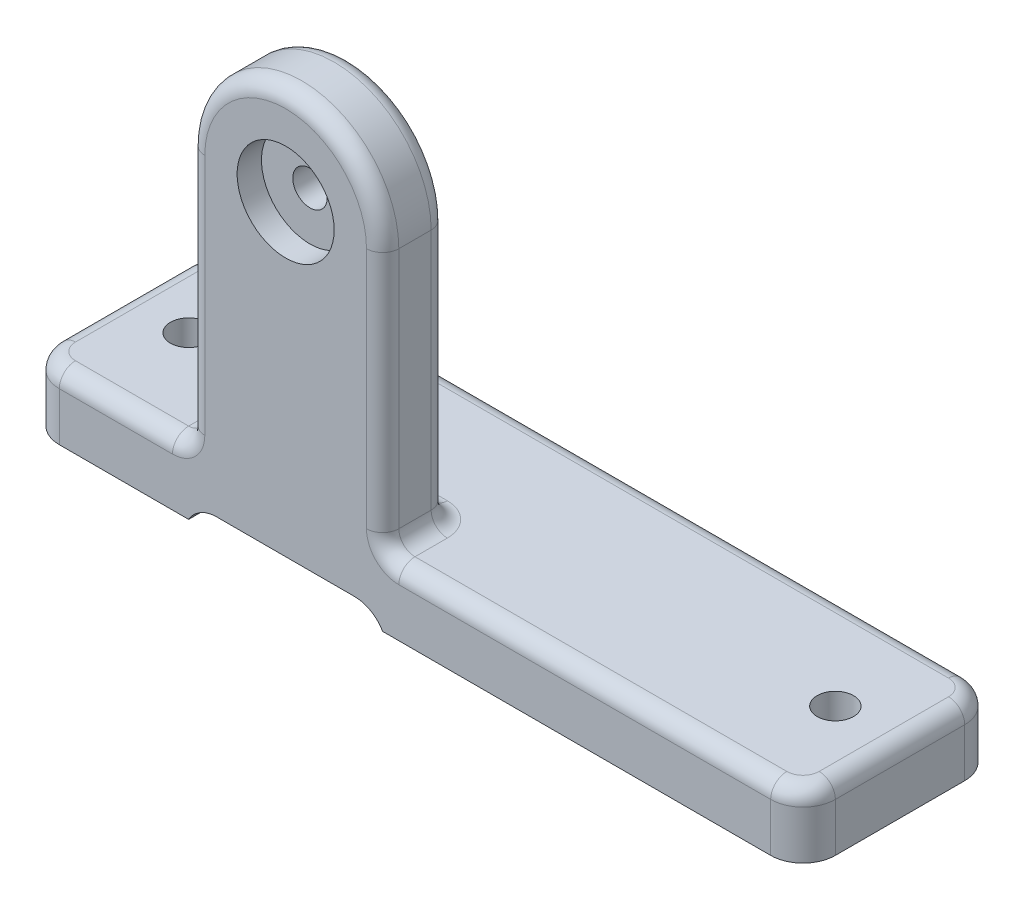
ISO-10303-21;
HEADER;
FILE_DESCRIPTION(('STEP AP214'),'2;1');
FILE_NAME('part.step','',(''),(''),'','','');
FILE_SCHEMA(('AUTOMOTIVE_DESIGN { 1 0 10303 214 1 1 1 1 }'));
ENDSEC;
DATA;
#1=APPLICATION_CONTEXT('core data for automotive mechanical design processes');
#2=APPLICATION_PROTOCOL_DEFINITION('international standard','automotive_design',2000,#1);
#3=PRODUCT_CONTEXT('',#1,'mechanical');
#4=PRODUCT('Part','Part','',(#3));
#5=PRODUCT_RELATED_PRODUCT_CATEGORY('part','',(#4));
#6=PRODUCT_DEFINITION_FORMATION('','',#4);
#7=PRODUCT_DEFINITION_CONTEXT('part definition',#1,'design');
#8=PRODUCT_DEFINITION('design','',#6,#7);
#9=PRODUCT_DEFINITION_SHAPE('','',#8);
#10=(LENGTH_UNIT() NAMED_UNIT(*) SI_UNIT(.MILLI.,.METRE.));
#11=(NAMED_UNIT(*) PLANE_ANGLE_UNIT() SI_UNIT($,.RADIAN.));
#12=(NAMED_UNIT(*) SI_UNIT($,.STERADIAN.) SOLID_ANGLE_UNIT());
#13=UNCERTAINTY_MEASURE_WITH_UNIT(LENGTH_MEASURE(1.E-05),#10,'distance_accuracy_value','');
#14=(GEOMETRIC_REPRESENTATION_CONTEXT(3) GLOBAL_UNCERTAINTY_ASSIGNED_CONTEXT((#13)) GLOBAL_UNIT_ASSIGNED_CONTEXT((#10,
#11,#12)) REPRESENTATION_CONTEXT('',''));
#15=CARTESIAN_POINT('',(0.,0.,0.));
#16=DIRECTION('',(0.,0.,1.));
#17=DIRECTION('',(1.,0.,0.));
#18=AXIS2_PLACEMENT_3D('',#15,#16,#17);
#19=CARTESIAN_POINT('',(0.,0.,-38.1));
#20=DIRECTION('',(0.,-1.,0.));
#21=DIRECTION('',(0.,0.,-1.));
#22=AXIS2_PLACEMENT_3D('',#19,#20,#21);
#23=PLANE('',#22);
#24=DIRECTION('',(-1.,0.,0.));
#25=VECTOR('',#24,1.);
#26=CARTESIAN_POINT('',(0.,0.,-38.1));
#27=LINE('',#26,#25);
#28=CARTESIAN_POINT('',(146.05,0.,-38.1));
#29=VERTEX_POINT('',#28);
#30=CARTESIAN_POINT('',(69.85,0.,-38.1));
#31=VERTEX_POINT('',#30);
#32=EDGE_CURVE('E268',#29,#31,#27,.T.);
#33=ORIENTED_EDGE('',*,*,#32,.F.);
#34=CARTESIAN_POINT('',(146.05,0.,-31.75));
#35=DIRECTION('',(0.,-1.,0.));
#36=DIRECTION('',(0.,0.,-1.));
#37=AXIS2_PLACEMENT_3D('',#34,#35,#36);
#38=CIRCLE('',#37,6.35);
#39=CARTESIAN_POINT('',(152.4,0.,-31.75));
#40=VERTEX_POINT('',#39);
#41=EDGE_CURVE('E296',#29,#40,#38,.T.);
#42=ORIENTED_EDGE('',*,*,#41,.T.);
#43=DIRECTION('',(0.,0.,-1.));
#44=VECTOR('',#43,1.);
#45=CARTESIAN_POINT('',(152.4,0.,0.));
#46=LINE('',#45,#44);
#47=CARTESIAN_POINT('',(152.4,0.,-6.35));
#48=VERTEX_POINT('',#47);
#49=EDGE_CURVE('E231',#48,#40,#46,.T.);
#50=ORIENTED_EDGE('',*,*,#49,.F.);
#51=CARTESIAN_POINT('',(146.05,0.,-6.35));
#52=DIRECTION('',(0.,-1.,0.));
#53=DIRECTION('',(0.,0.,-1.));
#54=AXIS2_PLACEMENT_3D('',#51,#52,#53);
#55=CIRCLE('',#54,6.35);
#56=CARTESIAN_POINT('',(146.05,0.,0.));
#57=VERTEX_POINT('',#56);
#58=EDGE_CURVE('E294',#48,#57,#55,.T.);
#59=ORIENTED_EDGE('',*,*,#58,.T.);
#60=DIRECTION('',(1.,0.,0.));
#61=VECTOR('',#60,1.);
#62=CARTESIAN_POINT('',(0.,0.,0.));
#63=LINE('',#62,#61);
#64=CARTESIAN_POINT('',(69.85,0.,0.));
#65=VERTEX_POINT('',#64);
#66=EDGE_CURVE('E232',#65,#57,#63,.T.);
#67=ORIENTED_EDGE('',*,*,#66,.F.);
#68=DIRECTION('',(0.,0.,1.));
#69=VECTOR('',#68,1.);
#70=CARTESIAN_POINT('',(69.85,0.,-38.1));
#71=LINE('',#70,#69);
#72=EDGE_CURVE('E239',#31,#65,#71,.T.);
#73=ORIENTED_EDGE('',*,*,#72,.F.);
#74=EDGE_LOOP('',(#33,#42,#50,#59,#67,#73));
#75=FACE_BOUND('',#74,.T.);
#76=CARTESIAN_POINT('',(139.7,0.,-19.05));
#77=DIRECTION('',(0.,1.,0.));
#78=DIRECTION('',(0.,0.,1.));
#79=AXIS2_PLACEMENT_3D('',#76,#77,#78);
#80=CIRCLE('',#79,3.571875);
#81=CARTESIAN_POINT('',(139.7,0.,-15.478125));
#82=VERTEX_POINT('',#81);
#83=EDGE_CURVE('E440',#82,#82,#80,.T.);
#84=ORIENTED_EDGE('',*,*,#83,.T.);
#85=EDGE_LOOP('',(#84));
#86=FACE_BOUND('',#85,.T.);
#87=ADVANCED_FACE('F28',(#75,#86),#23,.T.);
#88=CARTESIAN_POINT('',(6.35,0.,0.));
#89=VERTEX_POINT('',#88);
#90=CARTESIAN_POINT('',(31.75,0.,0.));
#91=VERTEX_POINT('',#90);
#92=EDGE_CURVE('E225',#89,#91,#63,.T.);
#93=ORIENTED_EDGE('',*,*,#92,.F.);
#94=CARTESIAN_POINT('',(6.35,0.,-6.35));
#95=DIRECTION('',(0.,-1.,0.));
#96=DIRECTION('',(0.,0.,-1.));
#97=AXIS2_PLACEMENT_3D('',#94,#95,#96);
#98=CIRCLE('',#97,6.35);
#99=CARTESIAN_POINT('',(0.,0.,-6.35));
#100=VERTEX_POINT('',#99);
#101=EDGE_CURVE('E282',#89,#100,#98,.T.);
#102=ORIENTED_EDGE('',*,*,#101,.T.);
#103=DIRECTION('',(0.,0.,1.));
#104=VECTOR('',#103,1.);
#105=CARTESIAN_POINT('',(0.,0.,0.));
#106=LINE('',#105,#104);
#107=CARTESIAN_POINT('',(0.,0.,-31.75));
#108=VERTEX_POINT('',#107);
#109=EDGE_CURVE('E261',#108,#100,#106,.T.);
#110=ORIENTED_EDGE('',*,*,#109,.F.);
#111=CARTESIAN_POINT('',(6.35,0.,-31.75));
#112=DIRECTION('',(0.,-1.,0.));
#113=DIRECTION('',(0.,0.,-1.));
#114=AXIS2_PLACEMENT_3D('',#111,#112,#113);
#115=CIRCLE('',#114,6.35);
#116=CARTESIAN_POINT('',(6.35,0.,-38.1));
#117=VERTEX_POINT('',#116);
#118=EDGE_CURVE('E280',#108,#117,#115,.T.);
#119=ORIENTED_EDGE('',*,*,#118,.T.);
#120=CARTESIAN_POINT('',(31.75,0.,-38.1));
#121=VERTEX_POINT('',#120);
#122=EDGE_CURVE('E238',#121,#117,#27,.T.);
#123=ORIENTED_EDGE('',*,*,#122,.F.);
#124=DIRECTION('',(0.,0.,1.));
#125=VECTOR('',#124,1.);
#126=CARTESIAN_POINT('',(31.75,0.,-38.1));
#127=LINE('',#126,#125);
#128=EDGE_CURVE('E216',#121,#91,#127,.T.);
#129=ORIENTED_EDGE('',*,*,#128,.T.);
#130=EDGE_LOOP('',(#93,#102,#110,#119,#123,#129));
#131=FACE_BOUND('',#130,.T.);
#132=CARTESIAN_POINT('',(12.7,0.,-19.05));
#133=DIRECTION('',(0.,1.,0.));
#134=DIRECTION('',(0.,0.,1.));
#135=AXIS2_PLACEMENT_3D('',#132,#133,#134);
#136=CIRCLE('',#135,3.571875);
#137=CARTESIAN_POINT('',(12.7,0.,-15.478125));
#138=VERTEX_POINT('',#137);
#139=EDGE_CURVE('E446',#138,#138,#136,.T.);
#140=ORIENTED_EDGE('',*,*,#139,.T.);
#141=EDGE_LOOP('',(#140));
#142=FACE_BOUND('',#141,.T.);
#143=ADVANCED_FACE('F235',(#131,#142),#23,.T.);
#144=CARTESIAN_POINT('',(0.,12.7,0.));
#145=DIRECTION('',(1.,0.,0.));
#146=DIRECTION('',(0.,0.,-1.));
#147=AXIS2_PLACEMENT_3D('',#144,#145,#146);
#148=PLANE('',#147);
#149=DIRECTION('',(0.,-1.,0.));
#150=VECTOR('',#149,1.);
#151=CARTESIAN_POINT('',(0.,12.7,-6.35));
#152=LINE('',#151,#150);
#153=CARTESIAN_POINT('',(0.,9.525,-6.35));
#154=VERTEX_POINT('',#153);
#155=EDGE_CURVE('E286',#100,#154,#152,.F.);
#156=ORIENTED_EDGE('',*,*,#155,.T.);
#157=DIRECTION('',(0.,0.,1.));
#158=VECTOR('',#157,1.);
#159=CARTESIAN_POINT('',(0.,9.525,0.));
#160=LINE('',#159,#158);
#161=CARTESIAN_POINT('',(0.,9.525,-31.75));
#162=VERTEX_POINT('',#161);
#163=EDGE_CURVE('E341',#154,#162,#160,.F.);
#164=ORIENTED_EDGE('',*,*,#163,.T.);
#165=DIRECTION('',(0.,-1.,0.));
#166=VECTOR('',#165,1.);
#167=CARTESIAN_POINT('',(0.,12.7,-31.75));
#168=LINE('',#167,#166);
#169=EDGE_CURVE('E284',#162,#108,#168,.T.);
#170=ORIENTED_EDGE('',*,*,#169,.T.);
#171=ORIENTED_EDGE('',*,*,#109,.T.);
#172=EDGE_LOOP('',(#156,#164,#170,#171));
#173=FACE_BOUND('',#172,.T.);
#174=ADVANCED_FACE('F30',(#173),#148,.F.);
#175=CARTESIAN_POINT('',(0.,12.7,0.));
#176=DIRECTION('',(0.,0.,-1.));
#177=DIRECTION('',(-1.,0.,0.));
#178=AXIS2_PLACEMENT_3D('',#175,#176,#177);
#179=PLANE('',#178);
#180=CARTESIAN_POINT('',(50.8,63.5,0.));
#181=DIRECTION('',(0.,0.,1.));
#182=DIRECTION('',(1.,0.,0.));
#183=AXIS2_PLACEMENT_3D('',#180,#181,#182);
#184=CIRCLE('',#183,9.52499999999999);
#185=CARTESIAN_POINT('',(60.325,63.5,0.));
#186=VERTEX_POINT('',#185);
#187=EDGE_CURVE('E254',#186,#186,#184,.T.);
#188=ORIENTED_EDGE('',*,*,#187,.F.);
#189=EDGE_LOOP('',(#188));
#190=FACE_BOUND('',#189,.T.);
#191=CARTESIAN_POINT('',(28.575,15.875,0.));
#192=DIRECTION('',(0.,0.,-1.));
#193=DIRECTION('',(-1.,0.,0.));
#194=AXIS2_PLACEMENT_3D('',#191,#192,#193);
#195=CIRCLE('',#194,6.35);
#196=CARTESIAN_POINT('',(28.575,9.525,0.));
#197=VERTEX_POINT('',#196);
#198=CARTESIAN_POINT('',(34.925,15.875,0.));
#199=VERTEX_POINT('',#198);
#200=EDGE_CURVE('E360',#197,#199,#195,.F.);
#201=ORIENTED_EDGE('',*,*,#200,.F.);
#202=DIRECTION('',(1.,0.,0.));
#203=VECTOR('',#202,1.);
#204=CARTESIAN_POINT('',(0.,9.525,0.));
#205=LINE('',#204,#203);
#206=CARTESIAN_POINT('',(6.35,9.525,0.));
#207=VERTEX_POINT('',#206);
#208=EDGE_CURVE('E363',#197,#207,#205,.F.);
#209=ORIENTED_EDGE('',*,*,#208,.T.);
#210=DIRECTION('',(0.,-1.,0.));
#211=VECTOR('',#210,1.);
#212=CARTESIAN_POINT('',(6.35,12.7,0.));
#213=LINE('',#212,#211);
#214=EDGE_CURVE('E228',#207,#89,#213,.T.);
#215=ORIENTED_EDGE('',*,*,#214,.T.);
#216=ORIENTED_EDGE('',*,*,#92,.T.);
#217=CARTESIAN_POINT('',(37.2492613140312,-3.175,0.));
#218=DIRECTION('',(0.,0.,-1.));
#219=DIRECTION('',(-1.,0.,0.));
#220=AXIS2_PLACEMENT_3D('',#217,#218,#219);
#221=CIRCLE('',#220,6.35);
#222=CARTESIAN_POINT('',(37.2492613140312,3.175,0.));
#223=VERTEX_POINT('',#222);
#224=EDGE_CURVE('E211',#91,#223,#221,.T.);
#225=ORIENTED_EDGE('',*,*,#224,.T.);
#226=DIRECTION('',(-1.,0.,0.));
#227=VECTOR('',#226,1.);
#228=CARTESIAN_POINT('',(31.75,3.175,0.));
#229=LINE('',#228,#227);
#230=CARTESIAN_POINT('',(64.3507386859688,3.175,0.));
#231=VERTEX_POINT('',#230);
#232=EDGE_CURVE('E246',#231,#223,#229,.T.);
#233=ORIENTED_EDGE('',*,*,#232,.F.);
#234=CARTESIAN_POINT('',(64.3507386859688,-3.175,0.));
#235=DIRECTION('',(0.,0.,-1.));
#236=DIRECTION('',(-1.,0.,0.));
#237=AXIS2_PLACEMENT_3D('',#234,#235,#236);
#238=CIRCLE('',#237,6.35);
#239=EDGE_CURVE('E303',#231,#65,#238,.T.);
#240=ORIENTED_EDGE('',*,*,#239,.T.);
#241=ORIENTED_EDGE('',*,*,#66,.T.);
#242=DIRECTION('',(0.,-1.,0.));
#243=VECTOR('',#242,1.);
#244=CARTESIAN_POINT('',(146.05,12.7,0.));
#245=LINE('',#244,#243);
#246=CARTESIAN_POINT('',(146.05,9.525,0.));
#247=VERTEX_POINT('',#246);
#248=EDGE_CURVE('E276',#57,#247,#245,.F.);
#249=ORIENTED_EDGE('',*,*,#248,.T.);
#250=DIRECTION('',(1.,0.,0.));
#251=VECTOR('',#250,1.);
#252=CARTESIAN_POINT('',(0.,9.525,0.));
#253=LINE('',#252,#251);
#254=CARTESIAN_POINT('',(73.025,9.525,0.));
#255=VERTEX_POINT('',#254);
#256=EDGE_CURVE('E358',#247,#255,#253,.F.);
#257=ORIENTED_EDGE('',*,*,#256,.T.);
#258=CARTESIAN_POINT('',(73.025,15.875,0.));
#259=DIRECTION('',(0.,0.,-1.));
#260=DIRECTION('',(-1.,0.,0.));
#261=AXIS2_PLACEMENT_3D('',#258,#259,#260);
#262=CIRCLE('',#261,6.35);
#263=CARTESIAN_POINT('',(66.675,15.875,0.));
#264=VERTEX_POINT('',#263);
#265=EDGE_CURVE('E355',#264,#255,#262,.F.);
#266=ORIENTED_EDGE('',*,*,#265,.F.);
#267=DIRECTION('',(0.,1.,0.));
#268=VECTOR('',#267,1.);
#269=CARTESIAN_POINT('',(66.675,63.5,0.));
#270=LINE('',#269,#268);
#271=CARTESIAN_POINT('',(66.675,63.5,0.));
#272=VERTEX_POINT('',#271);
#273=EDGE_CURVE('E353',#264,#272,#270,.T.);
#274=ORIENTED_EDGE('',*,*,#273,.T.);
#275=CARTESIAN_POINT('',(50.8,63.5,0.));
#276=DIRECTION('',(0.,0.,-1.));
#277=DIRECTION('',(-1.,0.,0.));
#278=AXIS2_PLACEMENT_3D('',#275,#276,#277);
#279=CIRCLE('',#278,15.875);
#280=CARTESIAN_POINT('',(34.925,63.5,0.));
#281=VERTEX_POINT('',#280);
#282=EDGE_CURVE('E349',#272,#281,#279,.F.);
#283=ORIENTED_EDGE('',*,*,#282,.T.);
#284=DIRECTION('',(0.,-1.,0.));
#285=VECTOR('',#284,1.);
#286=CARTESIAN_POINT('',(34.925,12.7,0.));
#287=LINE('',#286,#285);
#288=EDGE_CURVE('E351',#281,#199,#287,.T.);
#289=ORIENTED_EDGE('',*,*,#288,.T.);
#290=EDGE_LOOP('',(#201,#209,#215,#216,#225,#233,#240,#241,#249,#257,#266,#274,#283,#289));
#291=FACE_BOUND('',#290,.T.);
#292=ADVANCED_FACE('F226',(#190,#291),#179,.F.);
#293=CARTESIAN_POINT('',(152.4,12.7,0.));
#294=DIRECTION('',(-1.,0.,0.));
#295=DIRECTION('',(0.,0.,1.));
#296=AXIS2_PLACEMENT_3D('',#293,#294,#295);
#297=PLANE('',#296);
#298=DIRECTION('',(0.,-1.,0.));
#299=VECTOR('',#298,1.);
#300=CARTESIAN_POINT('',(152.4,12.7,-31.75));
#301=LINE('',#300,#299);
#302=CARTESIAN_POINT('',(152.4,9.525,-31.75));
#303=VERTEX_POINT('',#302);
#304=EDGE_CURVE('E300',#40,#303,#301,.F.);
#305=ORIENTED_EDGE('',*,*,#304,.T.);
#306=DIRECTION('',(0.,0.,-1.));
#307=VECTOR('',#306,1.);
#308=CARTESIAN_POINT('',(152.4,9.525,0.));
#309=LINE('',#308,#307);
#310=CARTESIAN_POINT('',(152.4,9.525,-6.35));
#311=VERTEX_POINT('',#310);
#312=EDGE_CURVE('E365',#303,#311,#309,.F.);
#313=ORIENTED_EDGE('',*,*,#312,.T.);
#314=DIRECTION('',(0.,-1.,0.));
#315=VECTOR('',#314,1.);
#316=CARTESIAN_POINT('',(152.4,12.7,-6.35));
#317=LINE('',#316,#315);
#318=EDGE_CURVE('E298',#311,#48,#317,.T.);
#319=ORIENTED_EDGE('',*,*,#318,.T.);
#320=ORIENTED_EDGE('',*,*,#49,.T.);
#321=EDGE_LOOP('',(#305,#313,#319,#320));
#322=FACE_BOUND('',#321,.T.);
#323=ADVANCED_FACE('F475',(#322),#297,.F.);
#324=CARTESIAN_POINT('',(0.,12.7,-38.1));
#325=DIRECTION('',(0.,0.,1.));
#326=DIRECTION('',(1.,0.,0.));
#327=AXIS2_PLACEMENT_3D('',#324,#325,#326);
#328=PLANE('',#327);
#329=DIRECTION('',(0.,-1.,0.));
#330=VECTOR('',#329,1.);
#331=CARTESIAN_POINT('',(6.35,12.7,-38.1));
#332=LINE('',#331,#330);
#333=CARTESIAN_POINT('',(6.35,9.525,-38.1));
#334=VERTEX_POINT('',#333);
#335=EDGE_CURVE('E291',#117,#334,#332,.F.);
#336=ORIENTED_EDGE('',*,*,#335,.T.);
#337=DIRECTION('',(-1.,0.,0.));
#338=VECTOR('',#337,1.);
#339=CARTESIAN_POINT('',(0.,9.525,-38.1));
#340=LINE('',#339,#338);
#341=CARTESIAN_POINT('',(146.05,9.525,-38.1));
#342=VERTEX_POINT('',#341);
#343=EDGE_CURVE('E343',#334,#342,#340,.F.);
#344=ORIENTED_EDGE('',*,*,#343,.T.);
#345=DIRECTION('',(0.,-1.,0.));
#346=VECTOR('',#345,1.);
#347=CARTESIAN_POINT('',(146.05,12.7,-38.1));
#348=LINE('',#347,#346);
#349=EDGE_CURVE('E289',#342,#29,#348,.T.);
#350=ORIENTED_EDGE('',*,*,#349,.T.);
#351=ORIENTED_EDGE('',*,*,#32,.T.);
#352=CARTESIAN_POINT('',(64.3507386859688,-3.175,-38.1));
#353=DIRECTION('',(0.,0.,1.));
#354=DIRECTION('',(1.,0.,0.));
#355=AXIS2_PLACEMENT_3D('',#352,#353,#354);
#356=CIRCLE('',#355,6.35);
#357=CARTESIAN_POINT('',(64.3507386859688,3.175,-38.1));
#358=VERTEX_POINT('',#357);
#359=EDGE_CURVE('E222',#31,#358,#356,.T.);
#360=ORIENTED_EDGE('',*,*,#359,.T.);
#361=DIRECTION('',(-1.,0.,0.));
#362=VECTOR('',#361,1.);
#363=CARTESIAN_POINT('',(31.75,3.175,-38.1));
#364=LINE('',#363,#362);
#365=CARTESIAN_POINT('',(37.2492613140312,3.175,-38.1));
#366=VERTEX_POINT('',#365);
#367=EDGE_CURVE('E240',#358,#366,#364,.T.);
#368=ORIENTED_EDGE('',*,*,#367,.T.);
#369=CARTESIAN_POINT('',(37.2492613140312,-3.175,-38.1));
#370=DIRECTION('',(0.,0.,1.));
#371=DIRECTION('',(1.,0.,0.));
#372=AXIS2_PLACEMENT_3D('',#369,#370,#371);
#373=CIRCLE('',#372,6.35);
#374=EDGE_CURVE('E221',#366,#121,#373,.T.);
#375=ORIENTED_EDGE('',*,*,#374,.T.);
#376=ORIENTED_EDGE('',*,*,#122,.T.);
#377=EDGE_LOOP('',(#336,#344,#350,#351,#360,#368,#375,#376));
#378=FACE_BOUND('',#377,.T.);
#379=ADVANCED_FACE('F469',(#378),#328,.F.);
#380=CARTESIAN_POINT('',(0.,12.7,-38.1));
#381=DIRECTION('',(0.,-1.,0.));
#382=DIRECTION('',(0.,0.,-1.));
#383=AXIS2_PLACEMENT_3D('',#380,#381,#382);
#384=PLANE('',#383);
#385=DIRECTION('',(-1.,0.,0.));
#386=VECTOR('',#385,1.);
#387=CARTESIAN_POINT('',(0.,12.7,-34.925));
#388=LINE('',#387,#386);
#389=CARTESIAN_POINT('',(146.05,12.7,-34.925));
#390=VERTEX_POINT('',#389);
#391=CARTESIAN_POINT('',(6.35,12.7,-34.925));
#392=VERTEX_POINT('',#391);
#393=EDGE_CURVE('E331',#390,#392,#388,.T.);
#394=ORIENTED_EDGE('',*,*,#393,.T.);
#395=CARTESIAN_POINT('',(6.35,12.7,-31.75));
#396=DIRECTION('',(0.,-1.,0.));
#397=DIRECTION('',(0.,0.,-1.));
#398=AXIS2_PLACEMENT_3D('',#395,#396,#397);
#399=CIRCLE('',#398,3.175);
#400=CARTESIAN_POINT('',(3.175,12.7,-31.75));
#401=VERTEX_POINT('',#400);
#402=EDGE_CURVE('E335',#392,#401,#399,.F.);
#403=ORIENTED_EDGE('',*,*,#402,.T.);
#404=DIRECTION('',(0.,0.,1.));
#405=VECTOR('',#404,1.);
#406=CARTESIAN_POINT('',(3.175,12.7,-38.1));
#407=LINE('',#406,#405);
#408=CARTESIAN_POINT('',(3.175,12.7,-6.35));
#409=VERTEX_POINT('',#408);
#410=EDGE_CURVE('E333',#401,#409,#407,.T.);
#411=ORIENTED_EDGE('',*,*,#410,.T.);
#412=CARTESIAN_POINT('',(6.35,12.7,-6.35));
#413=DIRECTION('',(0.,-1.,0.));
#414=DIRECTION('',(0.,0.,-1.));
#415=AXIS2_PLACEMENT_3D('',#412,#413,#414);
#416=CIRCLE('',#415,3.175);
#417=CARTESIAN_POINT('',(6.35,12.7,-3.175));
#418=VERTEX_POINT('',#417);
#419=EDGE_CURVE('E329',#409,#418,#416,.F.);
#420=ORIENTED_EDGE('',*,*,#419,.T.);
#421=DIRECTION('',(1.,0.,0.));
#422=VECTOR('',#421,1.);
#423=CARTESIAN_POINT('',(0.,12.7,-3.175));
#424=LINE('',#423,#422);
#425=CARTESIAN_POINT('',(28.575,12.7,-3.175));
#426=VERTEX_POINT('',#425);
#427=EDGE_CURVE('E325',#418,#426,#424,.T.);
#428=ORIENTED_EDGE('',*,*,#427,.T.);
#429=DIRECTION('',(0.,0.,-1.));
#430=VECTOR('',#429,1.);
#431=CARTESIAN_POINT('',(28.575,12.7,-38.1));
#432=LINE('',#431,#430);
#433=CARTESIAN_POINT('',(28.575,12.7,-9.525));
#434=VERTEX_POINT('',#433);
#435=EDGE_CURVE('E321',#426,#434,#432,.T.);
#436=ORIENTED_EDGE('',*,*,#435,.T.);
#437=CARTESIAN_POINT('',(34.925,12.7,-9.525));
#438=DIRECTION('',(0.,-1.,0.));
#439=DIRECTION('',(0.,0.,-1.));
#440=AXIS2_PLACEMENT_3D('',#437,#438,#439);
#441=CIRCLE('',#440,6.35);
#442=CARTESIAN_POINT('',(34.925,12.7,-15.875));
#443=VERTEX_POINT('',#442);
#444=EDGE_CURVE('E318',#443,#434,#441,.F.);
#445=ORIENTED_EDGE('',*,*,#444,.F.);
#446=DIRECTION('',(1.,0.,0.));
#447=VECTOR('',#446,1.);
#448=CARTESIAN_POINT('',(0.,12.7,-15.875));
#449=LINE('',#448,#447);
#450=CARTESIAN_POINT('',(66.675,12.7,-15.875));
#451=VERTEX_POINT('',#450);
#452=EDGE_CURVE('E314',#443,#451,#449,.T.);
#453=ORIENTED_EDGE('',*,*,#452,.T.);
#454=CARTESIAN_POINT('',(66.675,12.7,-9.525));
#455=DIRECTION('',(0.,-1.,0.));
#456=DIRECTION('',(0.,0.,-1.));
#457=AXIS2_PLACEMENT_3D('',#454,#455,#456);
#458=CIRCLE('',#457,6.35);
#459=CARTESIAN_POINT('',(73.025,12.7,-9.525));
#460=VERTEX_POINT('',#459);
#461=EDGE_CURVE('E311',#460,#451,#458,.F.);
#462=ORIENTED_EDGE('',*,*,#461,.F.);
#463=DIRECTION('',(0.,0.,1.));
#464=VECTOR('',#463,1.);
#465=CARTESIAN_POINT('',(73.025,12.7,-38.1));
#466=LINE('',#465,#464);
#467=CARTESIAN_POINT('',(73.025,12.7,-3.175));
#468=VERTEX_POINT('',#467);
#469=EDGE_CURVE('E307',#460,#468,#466,.T.);
#470=ORIENTED_EDGE('',*,*,#469,.T.);
#471=DIRECTION('',(1.,0.,0.));
#472=VECTOR('',#471,1.);
#473=CARTESIAN_POINT('',(0.,12.7,-3.175));
#474=LINE('',#473,#472);
#475=CARTESIAN_POINT('',(146.05,12.7,-3.175));
#476=VERTEX_POINT('',#475);
#477=EDGE_CURVE('E309',#468,#476,#474,.T.);
#478=ORIENTED_EDGE('',*,*,#477,.T.);
#479=CARTESIAN_POINT('',(146.05,12.7,-6.35));
#480=DIRECTION('',(0.,-1.,0.));
#481=DIRECTION('',(0.,0.,-1.));
#482=AXIS2_PLACEMENT_3D('',#479,#480,#481);
#483=CIRCLE('',#482,3.175);
#484=CARTESIAN_POINT('',(149.225,12.7,-6.35));
#485=VERTEX_POINT('',#484);
#486=EDGE_CURVE('E316',#476,#485,#483,.F.);
#487=ORIENTED_EDGE('',*,*,#486,.T.);
#488=DIRECTION('',(0.,0.,-1.));
#489=VECTOR('',#488,1.);
#490=CARTESIAN_POINT('',(149.225,12.7,-38.1));
#491=LINE('',#490,#489);
#492=CARTESIAN_POINT('',(149.225,12.7,-31.75));
#493=VERTEX_POINT('',#492);
#494=EDGE_CURVE('E323',#485,#493,#491,.T.);
#495=ORIENTED_EDGE('',*,*,#494,.T.);
#496=CARTESIAN_POINT('',(146.05,12.7,-31.75));
#497=DIRECTION('',(0.,-1.,0.));
#498=DIRECTION('',(0.,0.,-1.));
#499=AXIS2_PLACEMENT_3D('',#496,#497,#498);
#500=CIRCLE('',#499,3.175);
#501=EDGE_CURVE('E327',#493,#390,#500,.F.);
#502=ORIENTED_EDGE('',*,*,#501,.T.);
#503=EDGE_LOOP('',(#394,#403,#411,#420,#428,#436,#445,#453,#462,#470,#478,#487,#495,#502));
#504=FACE_BOUND('',#503,.T.);
#505=CARTESIAN_POINT('',(139.7,12.7,-19.05));
#506=DIRECTION('',(0.,1.,0.));
#507=DIRECTION('',(0.,0.,1.));
#508=AXIS2_PLACEMENT_3D('',#505,#506,#507);
#509=CIRCLE('',#508,3.57187499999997);
#510=CARTESIAN_POINT('',(139.7,12.7,-15.478125));
#511=VERTEX_POINT('',#510);
#512=EDGE_CURVE('E443',#511,#511,#509,.T.);
#513=ORIENTED_EDGE('',*,*,#512,.F.);
#514=EDGE_LOOP('',(#513));
#515=FACE_BOUND('',#514,.T.);
#516=CARTESIAN_POINT('',(12.7,12.7,-19.05));
#517=DIRECTION('',(0.,1.,0.));
#518=DIRECTION('',(0.,0.,1.));
#519=AXIS2_PLACEMENT_3D('',#516,#517,#518);
#520=CIRCLE('',#519,3.57187499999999);
#521=CARTESIAN_POINT('',(12.7,12.7,-15.478125));
#522=VERTEX_POINT('',#521);
#523=EDGE_CURVE('E449',#522,#522,#520,.T.);
#524=ORIENTED_EDGE('',*,*,#523,.F.);
#525=EDGE_LOOP('',(#524));
#526=FACE_BOUND('',#525,.T.);
#527=ADVANCED_FACE('F533',(#504,#515,#526),#384,.F.);
#528=CARTESIAN_POINT('',(31.75,0.,-12.7));
#529=DIRECTION('',(-1.,0.,0.));
#530=DIRECTION('',(0.,-1.,0.));
#531=AXIS2_PLACEMENT_3D('',#528,#529,#530);
#532=PLANE('',#531);
#533=DIRECTION('',(0.,0.,1.));
#534=VECTOR('',#533,1.);
#535=CARTESIAN_POINT('',(31.75,63.5,-12.7));
#536=LINE('',#535,#534);
#537=CARTESIAN_POINT('',(31.75,63.5,-9.525));
#538=VERTEX_POINT('',#537);
#539=CARTESIAN_POINT('',(31.75,63.5,-3.175));
#540=VERTEX_POINT('',#539);
#541=EDGE_CURVE('E258',#538,#540,#536,.T.);
#542=ORIENTED_EDGE('',*,*,#541,.F.);
#543=DIRECTION('',(0.,-1.,0.));
#544=VECTOR('',#543,1.);
#545=CARTESIAN_POINT('',(31.75,0.,-9.525));
#546=LINE('',#545,#544);
#547=CARTESIAN_POINT('',(31.75,15.875,-9.525));
#548=VERTEX_POINT('',#547);
#549=EDGE_CURVE('E372',#538,#548,#546,.T.);
#550=ORIENTED_EDGE('',*,*,#549,.T.);
#551=DIRECTION('',(0.,0.,-1.));
#552=VECTOR('',#551,1.);
#553=CARTESIAN_POINT('',(31.75,15.875,-12.7));
#554=LINE('',#553,#552);
#555=CARTESIAN_POINT('',(31.75,15.875,-3.175));
#556=VERTEX_POINT('',#555);
#557=EDGE_CURVE('E369',#548,#556,#554,.F.);
#558=ORIENTED_EDGE('',*,*,#557,.T.);
#559=DIRECTION('',(0.,-1.,0.));
#560=VECTOR('',#559,1.);
#561=CARTESIAN_POINT('',(31.75,63.5,-3.175));
#562=LINE('',#561,#560);
#563=EDGE_CURVE('E367',#556,#540,#562,.F.);
#564=ORIENTED_EDGE('',*,*,#563,.T.);
#565=EDGE_LOOP('',(#542,#550,#558,#564));
#566=FACE_BOUND('',#565,.T.);
#567=ADVANCED_FACE('F622',(#566),#532,.T.);
#568=CARTESIAN_POINT('',(69.85,63.5,-12.7));
#569=DIRECTION('',(1.,0.,0.));
#570=DIRECTION('',(0.,0.,-1.));
#571=AXIS2_PLACEMENT_3D('',#568,#569,#570);
#572=PLANE('',#571);
#573=DIRECTION('',(0.,0.,1.));
#574=VECTOR('',#573,1.);
#575=CARTESIAN_POINT('',(69.85,15.875,-12.7));
#576=LINE('',#575,#574);
#577=CARTESIAN_POINT('',(69.85,15.875,-3.175));
#578=VERTEX_POINT('',#577);
#579=CARTESIAN_POINT('',(69.85,15.875,-9.525));
#580=VERTEX_POINT('',#579);
#581=EDGE_CURVE('E43',#578,#580,#576,.F.);
#582=ORIENTED_EDGE('',*,*,#581,.T.);
#583=DIRECTION('',(0.,1.,0.));
#584=VECTOR('',#583,1.);
#585=CARTESIAN_POINT('',(69.85,63.5,-9.525));
#586=LINE('',#585,#584);
#587=CARTESIAN_POINT('',(69.85,63.5,-9.525));
#588=VERTEX_POINT('',#587);
#589=EDGE_CURVE('E387',#580,#588,#586,.T.);
#590=ORIENTED_EDGE('',*,*,#589,.T.);
#591=DIRECTION('',(0.,0.,1.));
#592=VECTOR('',#591,1.);
#593=CARTESIAN_POINT('',(69.85,63.5,-12.7));
#594=LINE('',#593,#592);
#595=CARTESIAN_POINT('',(69.85,63.5,-3.175));
#596=VERTEX_POINT('',#595);
#597=EDGE_CURVE('E262',#588,#596,#594,.T.);
#598=ORIENTED_EDGE('',*,*,#597,.T.);
#599=DIRECTION('',(0.,1.,0.));
#600=VECTOR('',#599,1.);
#601=CARTESIAN_POINT('',(69.85,12.7,-3.175));
#602=LINE('',#601,#600);
#603=EDGE_CURVE('E48',#596,#578,#602,.F.);
#604=ORIENTED_EDGE('',*,*,#603,.T.);
#605=EDGE_LOOP('',(#582,#590,#598,#604));
#606=FACE_BOUND('',#605,.T.);
#607=ADVANCED_FACE('F398',(#606),#572,.T.);
#608=CARTESIAN_POINT('',(50.8,63.5,-12.7));
#609=DIRECTION('',(0.,0.,-1.));
#610=DIRECTION('',(-1.,0.,0.));
#611=AXIS2_PLACEMENT_3D('',#608,#609,#610);
#612=PLANE('',#611);
#613=DIRECTION('',(0.,1.,0.));
#614=VECTOR('',#613,1.);
#615=CARTESIAN_POINT('',(66.675,63.5,-12.7));
#616=LINE('',#615,#614);
#617=CARTESIAN_POINT('',(66.675,63.5,-12.7));
#618=VERTEX_POINT('',#617);
#619=CARTESIAN_POINT('',(66.675,15.875,-12.7));
#620=VERTEX_POINT('',#619);
#621=EDGE_CURVE('E380',#618,#620,#616,.F.);
#622=ORIENTED_EDGE('',*,*,#621,.T.);
#623=DIRECTION('',(1.,0.,0.));
#624=VECTOR('',#623,1.);
#625=CARTESIAN_POINT('',(50.8,15.875,-12.7));
#626=LINE('',#625,#624);
#627=CARTESIAN_POINT('',(34.925,15.875,-12.7));
#628=VERTEX_POINT('',#627);
#629=EDGE_CURVE('E382',#620,#628,#626,.F.);
#630=ORIENTED_EDGE('',*,*,#629,.T.);
#631=DIRECTION('',(0.,-1.,0.));
#632=VECTOR('',#631,1.);
#633=CARTESIAN_POINT('',(34.925,63.5,-12.7));
#634=LINE('',#633,#632);
#635=CARTESIAN_POINT('',(34.925,63.5,-12.7));
#636=VERTEX_POINT('',#635);
#637=EDGE_CURVE('E378',#628,#636,#634,.F.);
#638=ORIENTED_EDGE('',*,*,#637,.T.);
#639=CARTESIAN_POINT('',(50.8,63.5,-12.7));
#640=DIRECTION('',(0.,0.,-1.));
#641=DIRECTION('',(-1.,0.,0.));
#642=AXIS2_PLACEMENT_3D('',#639,#640,#641);
#643=CIRCLE('',#642,15.875);
#644=EDGE_CURVE('E376',#636,#618,#643,.T.);
#645=ORIENTED_EDGE('',*,*,#644,.T.);
#646=EDGE_LOOP('',(#622,#630,#638,#645));
#647=FACE_BOUND('',#646,.T.);
#648=CARTESIAN_POINT('',(50.8,63.5,-12.7));
#649=DIRECTION('',(0.,0.,-1.));
#650=DIRECTION('',(-1.,0.,0.));
#651=AXIS2_PLACEMENT_3D('',#648,#649,#650);
#652=CIRCLE('',#651,3.37819999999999);
#653=CARTESIAN_POINT('',(47.4218,63.5,-12.7));
#654=VERTEX_POINT('',#653);
#655=EDGE_CURVE('E257',#654,#654,#652,.T.);
#656=ORIENTED_EDGE('',*,*,#655,.F.);
#657=EDGE_LOOP('',(#656));
#658=FACE_BOUND('',#657,.T.);
#659=ADVANCED_FACE('F645',(#647,#658),#612,.T.);
#660=CARTESIAN_POINT('',(50.8,63.5,-12.7));
#661=DIRECTION('',(0.,0.,1.));
#662=DIRECTION('',(1.,0.,0.));
#663=AXIS2_PLACEMENT_3D('',#660,#661,#662);
#664=CYLINDRICAL_SURFACE('',#663,19.05);
#665=ORIENTED_EDGE('',*,*,#597,.F.);
#666=CARTESIAN_POINT('',(50.8,63.5,-9.525));
#667=DIRECTION('',(0.,0.,-1.));
#668=DIRECTION('',(-1.,0.,0.));
#669=AXIS2_PLACEMENT_3D('',#666,#667,#668);
#670=CIRCLE('',#669,19.05);
#671=EDGE_CURVE('E11',#588,#538,#670,.F.);
#672=ORIENTED_EDGE('',*,*,#671,.T.);
#673=ORIENTED_EDGE('',*,*,#541,.T.);
#674=CARTESIAN_POINT('',(50.8,63.5,-3.175));
#675=DIRECTION('',(0.,0.,-1.));
#676=DIRECTION('',(-1.,0.,0.));
#677=AXIS2_PLACEMENT_3D('',#674,#675,#676);
#678=CIRCLE('',#677,19.05);
#679=EDGE_CURVE('E36',#540,#596,#678,.T.);
#680=ORIENTED_EDGE('',*,*,#679,.T.);
#681=EDGE_LOOP('',(#665,#672,#673,#680));
#682=FACE_BOUND('',#681,.T.);
#683=ADVANCED_FACE('F391',(#682),#664,.T.);
#684=CARTESIAN_POINT('',(50.8,63.5,0.));
#685=DIRECTION('',(0.,0.,1.));
#686=DIRECTION('',(1.,0.,0.));
#687=AXIS2_PLACEMENT_3D('',#684,#685,#686);
#688=CYLINDRICAL_SURFACE('',#687,9.52499999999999);
#689=CARTESIAN_POINT('',(50.8,63.5,-4.7752));
#690=DIRECTION('',(0.,0.,1.));
#691=DIRECTION('',(1.,0.,0.));
#692=AXIS2_PLACEMENT_3D('',#689,#690,#691);
#693=CIRCLE('',#692,9.52499999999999);
#694=CARTESIAN_POINT('',(60.325,63.5,-4.7752));
#695=VERTEX_POINT('',#694);
#696=EDGE_CURVE('E251',#695,#695,#693,.T.);
#697=ORIENTED_EDGE('',*,*,#696,.F.);
#698=EDGE_LOOP('',(#697));
#699=FACE_BOUND('',#698,.T.);
#700=ORIENTED_EDGE('',*,*,#187,.T.);
#701=EDGE_LOOP('',(#700));
#702=FACE_BOUND('',#701,.T.);
#703=ADVANCED_FACE('F633',(#699,#702),#688,.F.);
#704=CARTESIAN_POINT('',(54.1782,63.5,-4.7752));
#705=DIRECTION('',(0.,0.,-1.));
#706=DIRECTION('',(-1.,0.,0.));
#707=AXIS2_PLACEMENT_3D('',#704,#705,#706);
#708=PLANE('',#707);
#709=CARTESIAN_POINT('',(50.8,63.5,-4.7752));
#710=DIRECTION('',(0.,0.,1.));
#711=DIRECTION('',(1.,0.,0.));
#712=AXIS2_PLACEMENT_3D('',#709,#710,#711);
#713=CIRCLE('',#712,3.3782);
#714=CARTESIAN_POINT('',(54.1782,63.5,-4.7752));
#715=VERTEX_POINT('',#714);
#716=EDGE_CURVE('E243',#715,#715,#713,.T.);
#717=ORIENTED_EDGE('',*,*,#716,.F.);
#718=EDGE_LOOP('',(#717));
#719=FACE_BOUND('',#718,.T.);
#720=ORIENTED_EDGE('',*,*,#696,.T.);
#721=EDGE_LOOP('',(#720));
#722=FACE_BOUND('',#721,.T.);
#723=ADVANCED_FACE('F635',(#719,#722),#708,.F.);
#724=CARTESIAN_POINT('',(50.8,63.5,0.));
#725=DIRECTION('',(0.,0.,1.));
#726=DIRECTION('',(1.,0.,0.));
#727=AXIS2_PLACEMENT_3D('',#724,#725,#726);
#728=CYLINDRICAL_SURFACE('',#727,3.37819999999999);
#729=ORIENTED_EDGE('',*,*,#655,.T.);
#730=EDGE_LOOP('',(#729));
#731=FACE_BOUND('',#730,.T.);
#732=ORIENTED_EDGE('',*,*,#716,.T.);
#733=EDGE_LOOP('',(#732));
#734=FACE_BOUND('',#733,.T.);
#735=ADVANCED_FACE('F641',(#731,#734),#728,.F.);
#736=CARTESIAN_POINT('',(31.75,3.175,-38.1));
#737=DIRECTION('',(0.,1.,0.));
#738=DIRECTION('',(0.,0.,1.));
#739=AXIS2_PLACEMENT_3D('',#736,#737,#738);
#740=PLANE('',#739);
#741=ORIENTED_EDGE('',*,*,#367,.F.);
#742=DIRECTION('',(0.,0.,-1.));
#743=VECTOR('',#742,1.);
#744=CARTESIAN_POINT('',(64.3507386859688,3.175,-38.1));
#745=LINE('',#744,#743);
#746=EDGE_CURVE('E273',#358,#231,#745,.F.);
#747=ORIENTED_EDGE('',*,*,#746,.T.);
#748=ORIENTED_EDGE('',*,*,#232,.T.);
#749=DIRECTION('',(0.,0.,1.));
#750=VECTOR('',#749,1.);
#751=CARTESIAN_POINT('',(37.2492613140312,3.175,-38.1));
#752=LINE('',#751,#750);
#753=EDGE_CURVE('E217',#223,#366,#752,.F.);
#754=ORIENTED_EDGE('',*,*,#753,.T.);
#755=EDGE_LOOP('',(#741,#747,#748,#754));
#756=FACE_BOUND('',#755,.T.);
#757=ADVANCED_FACE('F454',(#756),#740,.F.);
#758=CARTESIAN_POINT('',(12.7,12.7,-19.05));
#759=DIRECTION('',(0.,1.,0.));
#760=DIRECTION('',(0.,0.,1.));
#761=AXIS2_PLACEMENT_3D('',#758,#759,#760);
#762=CYLINDRICAL_SURFACE('',#761,3.57187499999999);
#763=ORIENTED_EDGE('',*,*,#139,.F.);
#764=EDGE_LOOP('',(#763));
#765=FACE_BOUND('',#764,.T.);
#766=ORIENTED_EDGE('',*,*,#523,.T.);
#767=EDGE_LOOP('',(#766));
#768=FACE_BOUND('',#767,.T.);
#769=ADVANCED_FACE('F691',(#765,#768),#762,.F.);
#770=CARTESIAN_POINT('',(139.7,12.7,-19.05));
#771=DIRECTION('',(0.,1.,0.));
#772=DIRECTION('',(0.,0.,1.));
#773=AXIS2_PLACEMENT_3D('',#770,#771,#772);
#774=CYLINDRICAL_SURFACE('',#773,3.57187499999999);
#775=ORIENTED_EDGE('',*,*,#83,.F.);
#776=EDGE_LOOP('',(#775));
#777=FACE_BOUND('',#776,.T.);
#778=ORIENTED_EDGE('',*,*,#512,.T.);
#779=EDGE_LOOP('',(#778));
#780=FACE_BOUND('',#779,.T.);
#781=ADVANCED_FACE('F689',(#777,#780),#774,.F.);
#782=CARTESIAN_POINT('',(64.3507386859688,-3.175,-38.1));
#783=DIRECTION('',(0.,0.,-1.));
#784=DIRECTION('',(-1.,0.,0.));
#785=AXIS2_PLACEMENT_3D('',#782,#783,#784);
#786=CYLINDRICAL_SURFACE('',#785,6.35);
#787=ORIENTED_EDGE('',*,*,#359,.F.);
#788=ORIENTED_EDGE('',*,*,#72,.T.);
#789=ORIENTED_EDGE('',*,*,#239,.F.);
#790=ORIENTED_EDGE('',*,*,#746,.F.);
#791=EDGE_LOOP('',(#787,#788,#789,#790));
#792=FACE_BOUND('',#791,.T.);
#793=ADVANCED_FACE('F467',(#792),#786,.F.);
#794=CARTESIAN_POINT('',(37.2492613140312,-3.175,-38.1));
#795=DIRECTION('',(0.,0.,1.));
#796=DIRECTION('',(1.,0.,0.));
#797=AXIS2_PLACEMENT_3D('',#794,#795,#796);
#798=CYLINDRICAL_SURFACE('',#797,6.35);
#799=ORIENTED_EDGE('',*,*,#374,.F.);
#800=ORIENTED_EDGE('',*,*,#753,.F.);
#801=ORIENTED_EDGE('',*,*,#224,.F.);
#802=ORIENTED_EDGE('',*,*,#128,.F.);
#803=EDGE_LOOP('',(#799,#800,#801,#802));
#804=FACE_BOUND('',#803,.T.);
#805=ADVANCED_FACE('F214',(#804),#798,.F.);
#806=CARTESIAN_POINT('',(6.35,12.7,-6.35));
#807=DIRECTION('',(0.,-1.,0.));
#808=DIRECTION('',(0.,0.,-1.));
#809=AXIS2_PLACEMENT_3D('',#806,#807,#808);
#810=CYLINDRICAL_SURFACE('',#809,6.35);
#811=ORIENTED_EDGE('',*,*,#214,.F.);
#812=CARTESIAN_POINT('',(6.35,9.525,-6.35));
#813=DIRECTION('',(0.,-1.,0.));
#814=DIRECTION('',(0.,0.,-1.));
#815=AXIS2_PLACEMENT_3D('',#812,#813,#814);
#816=CIRCLE('',#815,6.35);
#817=EDGE_CURVE('E345',#207,#154,#816,.T.);
#818=ORIENTED_EDGE('',*,*,#817,.T.);
#819=ORIENTED_EDGE('',*,*,#155,.F.);
#820=ORIENTED_EDGE('',*,*,#101,.F.);
#821=EDGE_LOOP('',(#811,#818,#819,#820));
#822=FACE_BOUND('',#821,.T.);
#823=ADVANCED_FACE('F578',(#822),#810,.T.);
#824=CARTESIAN_POINT('',(6.35,12.7,-31.75));
#825=DIRECTION('',(0.,-1.,0.));
#826=DIRECTION('',(0.,0.,-1.));
#827=AXIS2_PLACEMENT_3D('',#824,#825,#826);
#828=CYLINDRICAL_SURFACE('',#827,6.35);
#829=ORIENTED_EDGE('',*,*,#169,.F.);
#830=CARTESIAN_POINT('',(6.35,9.525,-31.75));
#831=DIRECTION('',(0.,-1.,0.));
#832=DIRECTION('',(0.,0.,-1.));
#833=AXIS2_PLACEMENT_3D('',#830,#831,#832);
#834=CIRCLE('',#833,6.35);
#835=EDGE_CURVE('E338',#162,#334,#834,.T.);
#836=ORIENTED_EDGE('',*,*,#835,.T.);
#837=ORIENTED_EDGE('',*,*,#335,.F.);
#838=ORIENTED_EDGE('',*,*,#118,.F.);
#839=EDGE_LOOP('',(#829,#836,#837,#838));
#840=FACE_BOUND('',#839,.T.);
#841=ADVANCED_FACE('F598',(#840),#828,.T.);
#842=CARTESIAN_POINT('',(146.05,12.7,-31.75));
#843=DIRECTION('',(0.,-1.,0.));
#844=DIRECTION('',(0.,0.,-1.));
#845=AXIS2_PLACEMENT_3D('',#842,#843,#844);
#846=CYLINDRICAL_SURFACE('',#845,6.35);
#847=ORIENTED_EDGE('',*,*,#349,.F.);
#848=CARTESIAN_POINT('',(146.05,9.525,-31.75));
#849=DIRECTION('',(0.,-1.,0.));
#850=DIRECTION('',(0.,0.,-1.));
#851=AXIS2_PLACEMENT_3D('',#848,#849,#850);
#852=CIRCLE('',#851,6.35);
#853=EDGE_CURVE('E347',#342,#303,#852,.T.);
#854=ORIENTED_EDGE('',*,*,#853,.T.);
#855=ORIENTED_EDGE('',*,*,#304,.F.);
#856=ORIENTED_EDGE('',*,*,#41,.F.);
#857=EDGE_LOOP('',(#847,#854,#855,#856));
#858=FACE_BOUND('',#857,.T.);
#859=ADVANCED_FACE('F478',(#858),#846,.T.);
#860=CARTESIAN_POINT('',(146.05,12.7,-6.35));
#861=DIRECTION('',(0.,-1.,0.));
#862=DIRECTION('',(0.,0.,-1.));
#863=AXIS2_PLACEMENT_3D('',#860,#861,#862);
#864=CYLINDRICAL_SURFACE('',#863,6.35);
#865=ORIENTED_EDGE('',*,*,#318,.F.);
#866=CARTESIAN_POINT('',(146.05,9.525,-6.35));
#867=DIRECTION('',(0.,-1.,0.));
#868=DIRECTION('',(0.,0.,-1.));
#869=AXIS2_PLACEMENT_3D('',#866,#867,#868);
#870=CIRCLE('',#869,6.35);
#871=EDGE_CURVE('E374',#311,#247,#870,.T.);
#872=ORIENTED_EDGE('',*,*,#871,.T.);
#873=ORIENTED_EDGE('',*,*,#248,.F.);
#874=ORIENTED_EDGE('',*,*,#58,.F.);
#875=EDGE_LOOP('',(#865,#872,#873,#874));
#876=FACE_BOUND('',#875,.T.);
#877=ADVANCED_FACE('F565',(#876),#864,.T.);
#878=CARTESIAN_POINT('',(66.675,63.5,-9.525));
#879=DIRECTION('',(0.,1.,0.));
#880=DIRECTION('',(0.,0.,1.));
#881=AXIS2_PLACEMENT_3D('',#878,#879,#880);
#882=CYLINDRICAL_SURFACE('',#881,3.175);
#883=CARTESIAN_POINT('',(66.675,15.875,-9.525));
#884=DIRECTION('',(0.,-1.,0.));
#885=DIRECTION('',(0.,0.,-1.));
#886=AXIS2_PLACEMENT_3D('',#883,#884,#885);
#887=CIRCLE('',#886,3.175);
#888=EDGE_CURVE('E437',#620,#580,#887,.T.);
#889=ORIENTED_EDGE('',*,*,#888,.F.);
#890=ORIENTED_EDGE('',*,*,#621,.F.);
#891=CARTESIAN_POINT('',(66.675,63.5,-9.525));
#892=DIRECTION('',(0.,1.,0.));
#893=DIRECTION('',(0.,0.,1.));
#894=AXIS2_PLACEMENT_3D('',#891,#892,#893);
#895=CIRCLE('',#894,3.175);
#896=EDGE_CURVE('E434',#588,#618,#895,.T.);
#897=ORIENTED_EDGE('',*,*,#896,.F.);
#898=ORIENTED_EDGE('',*,*,#589,.F.);
#899=EDGE_LOOP('',(#889,#890,#897,#898));
#900=FACE_BOUND('',#899,.T.);
#901=ADVANCED_FACE('F668',(#900),#882,.T.);
#902=CARTESIAN_POINT('',(66.675,15.875,-9.525));
#903=DIRECTION('',(0.,-1.,0.));
#904=DIRECTION('',(0.,0.,-1.));
#905=AXIS2_PLACEMENT_3D('',#902,#903,#904);
#906=TOROIDAL_SURFACE('',#905,6.35,3.175);
#907=CARTESIAN_POINT('',(66.675,15.875,-15.875));
#908=DIRECTION('',(-1.,0.,0.));
#909=DIRECTION('',(0.,0.,1.));
#910=AXIS2_PLACEMENT_3D('',#907,#908,#909);
#911=CIRCLE('',#910,3.175);
#912=EDGE_CURVE('E428',#620,#451,#911,.F.);
#913=ORIENTED_EDGE('',*,*,#912,.F.);
#914=ORIENTED_EDGE('',*,*,#888,.T.);
#915=CARTESIAN_POINT('',(73.025,15.875,-9.525));
#916=DIRECTION('',(0.,0.,1.));
#917=DIRECTION('',(1.,0.,0.));
#918=AXIS2_PLACEMENT_3D('',#915,#916,#917);
#919=CIRCLE('',#918,3.175);
#920=EDGE_CURVE('E431',#460,#580,#919,.F.);
#921=ORIENTED_EDGE('',*,*,#920,.F.);
#922=ORIENTED_EDGE('',*,*,#461,.T.);
#923=EDGE_LOOP('',(#913,#914,#921,#922));
#924=FACE_BOUND('',#923,.T.);
#925=ADVANCED_FACE('F541',(#924),#906,.F.);
#926=CARTESIAN_POINT('',(50.8,63.5,-9.525));
#927=DIRECTION('',(0.,0.,-1.));
#928=DIRECTION('',(-1.,0.,0.));
#929=AXIS2_PLACEMENT_3D('',#926,#927,#928);
#930=TOROIDAL_SURFACE('',#929,15.875,3.175);
#931=ORIENTED_EDGE('',*,*,#896,.T.);
#932=ORIENTED_EDGE('',*,*,#644,.F.);
#933=CARTESIAN_POINT('',(34.925,63.5,-9.525));
#934=DIRECTION('',(0.,-1.,0.));
#935=DIRECTION('',(0.,0.,-1.));
#936=AXIS2_PLACEMENT_3D('',#933,#934,#935);
#937=CIRCLE('',#936,3.175);
#938=EDGE_CURVE('E425',#538,#636,#937,.T.);
#939=ORIENTED_EDGE('',*,*,#938,.F.);
#940=ORIENTED_EDGE('',*,*,#671,.F.);
#941=EDGE_LOOP('',(#931,#932,#939,#940));
#942=FACE_BOUND('',#941,.T.);
#943=ADVANCED_FACE('F662',(#942),#930,.T.);
#944=CARTESIAN_POINT('',(73.025,15.875,-38.1));
#945=DIRECTION('',(0.,0.,1.));
#946=DIRECTION('',(1.,0.,0.));
#947=AXIS2_PLACEMENT_3D('',#944,#945,#946);
#948=CYLINDRICAL_SURFACE('',#947,3.175);
#949=ORIENTED_EDGE('',*,*,#920,.T.);
#950=ORIENTED_EDGE('',*,*,#581,.F.);
#951=CARTESIAN_POINT('',(73.025,15.875,-3.175));
#952=DIRECTION('',(0.,0.,-1.));
#953=DIRECTION('',(-1.,0.,0.));
#954=AXIS2_PLACEMENT_3D('',#951,#952,#953);
#955=CIRCLE('',#954,3.175);
#956=EDGE_CURVE('E422',#468,#578,#955,.T.);
#957=ORIENTED_EDGE('',*,*,#956,.F.);
#958=ORIENTED_EDGE('',*,*,#469,.F.);
#959=EDGE_LOOP('',(#949,#950,#957,#958));
#960=FACE_BOUND('',#959,.T.);
#961=ADVANCED_FACE('F550',(#960),#948,.F.);
#962=CARTESIAN_POINT('',(0.,15.875,-15.875));
#963=DIRECTION('',(1.,0.,0.));
#964=DIRECTION('',(0.,0.,-1.));
#965=AXIS2_PLACEMENT_3D('',#962,#963,#964);
#966=CYLINDRICAL_SURFACE('',#965,3.175);
#967=ORIENTED_EDGE('',*,*,#912,.T.);
#968=ORIENTED_EDGE('',*,*,#452,.F.);
#969=CARTESIAN_POINT('',(34.925,15.875,-15.875));
#970=DIRECTION('',(1.,0.,0.));
#971=DIRECTION('',(0.,0.,-1.));
#972=AXIS2_PLACEMENT_3D('',#969,#970,#971);
#973=CIRCLE('',#972,3.175);
#974=EDGE_CURVE('E413',#628,#443,#973,.T.);
#975=ORIENTED_EDGE('',*,*,#974,.F.);
#976=ORIENTED_EDGE('',*,*,#629,.F.);
#977=EDGE_LOOP('',(#967,#968,#975,#976));
#978=FACE_BOUND('',#977,.T.);
#979=ADVANCED_FACE('F536',(#978),#966,.F.);
#980=CARTESIAN_POINT('',(34.925,0.,-9.525));
#981=DIRECTION('',(0.,-1.,0.));
#982=DIRECTION('',(1.,0.,0.));
#983=AXIS2_PLACEMENT_3D('',#980,#981,#982);
#984=CYLINDRICAL_SURFACE('',#983,3.175);
#985=ORIENTED_EDGE('',*,*,#938,.T.);
#986=ORIENTED_EDGE('',*,*,#637,.F.);
#987=CARTESIAN_POINT('',(34.925,15.875,-9.525));
#988=DIRECTION('',(0.,-1.,0.));
#989=DIRECTION('',(0.,0.,-1.));
#990=AXIS2_PLACEMENT_3D('',#987,#988,#989);
#991=CIRCLE('',#990,3.175);
#992=EDGE_CURVE('E410',#548,#628,#991,.T.);
#993=ORIENTED_EDGE('',*,*,#992,.F.);
#994=ORIENTED_EDGE('',*,*,#549,.F.);
#995=EDGE_LOOP('',(#985,#986,#993,#994));
#996=FACE_BOUND('',#995,.T.);
#997=ADVANCED_FACE('F664',(#996),#984,.T.);
#998=CARTESIAN_POINT('',(66.675,12.7,-3.175));
#999=DIRECTION('',(0.,-1.,0.));
#1000=DIRECTION('',(0.,0.,-1.));
#1001=AXIS2_PLACEMENT_3D('',#998,#999,#1000);
#1002=CYLINDRICAL_SURFACE('',#1001,3.175);
#1003=CARTESIAN_POINT('',(66.675,63.5,-3.175));
#1004=DIRECTION('',(0.,1.,0.));
#1005=DIRECTION('',(0.,0.,1.));
#1006=AXIS2_PLACEMENT_3D('',#1003,#1004,#1005);
#1007=CIRCLE('',#1006,3.175);
#1008=EDGE_CURVE('E404',#272,#596,#1007,.T.);
#1009=ORIENTED_EDGE('',*,*,#1008,.F.);
#1010=ORIENTED_EDGE('',*,*,#273,.F.);
#1011=CARTESIAN_POINT('',(66.675,15.875,-3.175));
#1012=DIRECTION('',(0.,-1.,0.));
#1013=DIRECTION('',(0.,0.,-1.));
#1014=AXIS2_PLACEMENT_3D('',#1011,#1012,#1013);
#1015=CIRCLE('',#1014,3.175);
#1016=EDGE_CURVE('E407',#578,#264,#1015,.T.);
#1017=ORIENTED_EDGE('',*,*,#1016,.F.);
#1018=ORIENTED_EDGE('',*,*,#603,.F.);
#1019=EDGE_LOOP('',(#1009,#1010,#1017,#1018));
#1020=FACE_BOUND('',#1019,.T.);
#1021=ADVANCED_FACE('F402',(#1020),#1002,.T.);
#1022=CARTESIAN_POINT('',(73.025,15.875,-3.175));
#1023=DIRECTION('',(0.,0.,-1.));
#1024=DIRECTION('',(-1.,0.,0.));
#1025=AXIS2_PLACEMENT_3D('',#1022,#1023,#1024);
#1026=TOROIDAL_SURFACE('',#1025,6.35,3.175);
#1027=ORIENTED_EDGE('',*,*,#1016,.T.);
#1028=ORIENTED_EDGE('',*,*,#265,.T.);
#1029=CARTESIAN_POINT('',(73.025,9.525,-3.175));
#1030=DIRECTION('',(-1.,0.,0.));
#1031=DIRECTION('',(0.,0.,1.));
#1032=AXIS2_PLACEMENT_3D('',#1029,#1030,#1031);
#1033=CIRCLE('',#1032,3.175);
#1034=EDGE_CURVE('E411',#468,#255,#1033,.F.);
#1035=ORIENTED_EDGE('',*,*,#1034,.F.);
#1036=ORIENTED_EDGE('',*,*,#956,.T.);
#1037=EDGE_LOOP('',(#1027,#1028,#1035,#1036));
#1038=FACE_BOUND('',#1037,.T.);
#1039=ADVANCED_FACE('F552',(#1038),#1026,.T.);
#1040=CARTESIAN_POINT('',(34.925,15.875,-9.525));
#1041=DIRECTION('',(0.,-1.,0.));
#1042=DIRECTION('',(0.,0.,-1.));
#1043=AXIS2_PLACEMENT_3D('',#1040,#1041,#1042);
#1044=TOROIDAL_SURFACE('',#1043,6.35,3.175);
#1045=ORIENTED_EDGE('',*,*,#974,.T.);
#1046=ORIENTED_EDGE('',*,*,#444,.T.);
#1047=CARTESIAN_POINT('',(28.575,15.875,-9.525));
#1048=DIRECTION('',(0.,0.,1.));
#1049=DIRECTION('',(1.,0.,0.));
#1050=AXIS2_PLACEMENT_3D('',#1047,#1048,#1049);
#1051=CIRCLE('',#1050,3.175);
#1052=EDGE_CURVE('E416',#548,#434,#1051,.F.);
#1053=ORIENTED_EDGE('',*,*,#1052,.F.);
#1054=ORIENTED_EDGE('',*,*,#992,.T.);
#1055=EDGE_LOOP('',(#1045,#1046,#1053,#1054));
#1056=FACE_BOUND('',#1055,.T.);
#1057=ADVANCED_FACE('F528',(#1056),#1044,.F.);
#1058=CARTESIAN_POINT('',(50.8,63.5,-3.175));
#1059=DIRECTION('',(0.,0.,-1.));
#1060=DIRECTION('',(-1.,0.,0.));
#1061=AXIS2_PLACEMENT_3D('',#1058,#1059,#1060);
#1062=TOROIDAL_SURFACE('',#1061,15.875,3.175);
#1063=ORIENTED_EDGE('',*,*,#1008,.T.);
#1064=ORIENTED_EDGE('',*,*,#679,.F.);
#1065=CARTESIAN_POINT('',(34.925,63.5,-3.175));
#1066=DIRECTION('',(0.,-1.,0.));
#1067=DIRECTION('',(0.,0.,-1.));
#1068=AXIS2_PLACEMENT_3D('',#1065,#1066,#1067);
#1069=CIRCLE('',#1068,3.175);
#1070=EDGE_CURVE('E519',#281,#540,#1069,.T.);
#1071=ORIENTED_EDGE('',*,*,#1070,.F.);
#1072=ORIENTED_EDGE('',*,*,#282,.F.);
#1073=EDGE_LOOP('',(#1063,#1064,#1071,#1072));
#1074=FACE_BOUND('',#1073,.T.);
#1075=ADVANCED_FACE('F409',(#1074),#1062,.T.);
#1076=CARTESIAN_POINT('',(0.,9.525,-3.175));
#1077=DIRECTION('',(1.,0.,0.));
#1078=DIRECTION('',(0.,0.,-1.));
#1079=AXIS2_PLACEMENT_3D('',#1076,#1077,#1078);
#1080=CYLINDRICAL_SURFACE('',#1079,3.175);
#1081=ORIENTED_EDGE('',*,*,#1034,.T.);
#1082=ORIENTED_EDGE('',*,*,#256,.F.);
#1083=CARTESIAN_POINT('',(146.05,9.525,-3.175));
#1084=DIRECTION('',(1.,0.,0.));
#1085=DIRECTION('',(0.,0.,-1.));
#1086=AXIS2_PLACEMENT_3D('',#1083,#1084,#1085);
#1087=CIRCLE('',#1086,3.175);
#1088=EDGE_CURVE('E516',#476,#247,#1087,.T.);
#1089=ORIENTED_EDGE('',*,*,#1088,.F.);
#1090=ORIENTED_EDGE('',*,*,#477,.F.);
#1091=EDGE_LOOP('',(#1081,#1082,#1089,#1090));
#1092=FACE_BOUND('',#1091,.T.);
#1093=ADVANCED_FACE('F555',(#1092),#1080,.T.);
#1094=CARTESIAN_POINT('',(28.575,15.875,-38.1));
#1095=DIRECTION('',(0.,0.,-1.));
#1096=DIRECTION('',(-1.,0.,0.));
#1097=AXIS2_PLACEMENT_3D('',#1094,#1095,#1096);
#1098=CYLINDRICAL_SURFACE('',#1097,3.175);
#1099=ORIENTED_EDGE('',*,*,#1052,.T.);
#1100=ORIENTED_EDGE('',*,*,#435,.F.);
#1101=CARTESIAN_POINT('',(28.575,15.875,-3.175));
#1102=DIRECTION('',(0.,0.,-1.));
#1103=DIRECTION('',(-1.,0.,0.));
#1104=AXIS2_PLACEMENT_3D('',#1101,#1102,#1103);
#1105=CIRCLE('',#1104,3.175);
#1106=EDGE_CURVE('E513',#556,#426,#1105,.T.);
#1107=ORIENTED_EDGE('',*,*,#1106,.F.);
#1108=ORIENTED_EDGE('',*,*,#557,.F.);
#1109=EDGE_LOOP('',(#1099,#1100,#1107,#1108));
#1110=FACE_BOUND('',#1109,.T.);
#1111=ADVANCED_FACE('F525',(#1110),#1098,.F.);
#1112=CARTESIAN_POINT('',(34.925,12.7,-3.175));
#1113=DIRECTION('',(0.,1.,0.));
#1114=DIRECTION('',(-1.,0.,0.));
#1115=AXIS2_PLACEMENT_3D('',#1112,#1113,#1114);
#1116=CYLINDRICAL_SURFACE('',#1115,3.175);
#1117=ORIENTED_EDGE('',*,*,#1070,.T.);
#1118=ORIENTED_EDGE('',*,*,#563,.F.);
#1119=CARTESIAN_POINT('',(34.925,15.875,-3.175));
#1120=DIRECTION('',(0.,-1.,0.));
#1121=DIRECTION('',(0.,0.,-1.));
#1122=AXIS2_PLACEMENT_3D('',#1119,#1120,#1121);
#1123=CIRCLE('',#1122,3.175);
#1124=EDGE_CURVE('E511',#199,#556,#1123,.T.);
#1125=ORIENTED_EDGE('',*,*,#1124,.F.);
#1126=ORIENTED_EDGE('',*,*,#288,.F.);
#1127=EDGE_LOOP('',(#1117,#1118,#1125,#1126));
#1128=FACE_BOUND('',#1127,.T.);
#1129=ADVANCED_FACE('F570',(#1128),#1116,.T.);
#1130=CARTESIAN_POINT('',(146.05,9.525,-6.35));
#1131=DIRECTION('',(0.,-1.,0.));
#1132=DIRECTION('',(0.,0.,-1.));
#1133=AXIS2_PLACEMENT_3D('',#1130,#1131,#1132);
#1134=DEGENERATE_TOROIDAL_SURFACE('',#1133,3.175,3.175,.T.);
#1135=ORIENTED_EDGE('',*,*,#1088,.T.);
#1136=ORIENTED_EDGE('',*,*,#871,.F.);
#1137=CARTESIAN_POINT('',(149.225,9.525,-6.35));
#1138=DIRECTION('',(0.,0.,-1.));
#1139=DIRECTION('',(-1.,0.,0.));
#1140=AXIS2_PLACEMENT_3D('',#1137,#1138,#1139);
#1141=CIRCLE('',#1140,3.175);
#1142=EDGE_CURVE('E508',#485,#311,#1141,.T.);
#1143=ORIENTED_EDGE('',*,*,#1142,.F.);
#1144=ORIENTED_EDGE('',*,*,#486,.F.);
#1145=EDGE_LOOP('',(#1135,#1136,#1143,#1144));
#1146=FACE_BOUND('',#1145,.T.);
#1147=ADVANCED_FACE('F560',(#1146),#1134,.T.);
#1148=CARTESIAN_POINT('',(28.575,15.875,-3.175));
#1149=DIRECTION('',(0.,0.,-1.));
#1150=DIRECTION('',(-1.,0.,0.));
#1151=AXIS2_PLACEMENT_3D('',#1148,#1149,#1150);
#1152=TOROIDAL_SURFACE('',#1151,6.35,3.175);
#1153=ORIENTED_EDGE('',*,*,#1124,.T.);
#1154=ORIENTED_EDGE('',*,*,#1106,.T.);
#1155=CARTESIAN_POINT('',(28.575,9.525,-3.175));
#1156=DIRECTION('',(1.,0.,0.));
#1157=DIRECTION('',(0.,0.,-1.));
#1158=AXIS2_PLACEMENT_3D('',#1155,#1156,#1157);
#1159=CIRCLE('',#1158,3.175);
#1160=EDGE_CURVE('E505',#197,#426,#1159,.F.);
#1161=ORIENTED_EDGE('',*,*,#1160,.F.);
#1162=ORIENTED_EDGE('',*,*,#200,.T.);
#1163=EDGE_LOOP('',(#1153,#1154,#1161,#1162));
#1164=FACE_BOUND('',#1163,.T.);
#1165=ADVANCED_FACE('F573',(#1164),#1152,.T.);
#1166=CARTESIAN_POINT('',(149.225,9.525,-38.1));
#1167=DIRECTION('',(0.,0.,-1.));
#1168=DIRECTION('',(-1.,0.,0.));
#1169=AXIS2_PLACEMENT_3D('',#1166,#1167,#1168);
#1170=CYLINDRICAL_SURFACE('',#1169,3.175);
#1171=ORIENTED_EDGE('',*,*,#1142,.T.);
#1172=ORIENTED_EDGE('',*,*,#312,.F.);
#1173=CARTESIAN_POINT('',(149.225,9.525,-31.75));
#1174=DIRECTION('',(0.,0.,-1.));
#1175=DIRECTION('',(-1.,0.,0.));
#1176=AXIS2_PLACEMENT_3D('',#1173,#1174,#1175);
#1177=CIRCLE('',#1176,3.175);
#1178=EDGE_CURVE('E489',#493,#303,#1177,.T.);
#1179=ORIENTED_EDGE('',*,*,#1178,.F.);
#1180=ORIENTED_EDGE('',*,*,#494,.F.);
#1181=EDGE_LOOP('',(#1171,#1172,#1179,#1180));
#1182=FACE_BOUND('',#1181,.T.);
#1183=ADVANCED_FACE('F563',(#1182),#1170,.T.);
#1184=CARTESIAN_POINT('',(0.,9.525,-3.175));
#1185=DIRECTION('',(1.,0.,0.));
#1186=DIRECTION('',(0.,0.,-1.));
#1187=AXIS2_PLACEMENT_3D('',#1184,#1185,#1186);
#1188=CYLINDRICAL_SURFACE('',#1187,3.175);
#1189=ORIENTED_EDGE('',*,*,#1160,.T.);
#1190=ORIENTED_EDGE('',*,*,#427,.F.);
#1191=CARTESIAN_POINT('',(6.35,9.525,-3.175));
#1192=DIRECTION('',(-1.,0.,0.));
#1193=DIRECTION('',(0.,0.,1.));
#1194=AXIS2_PLACEMENT_3D('',#1191,#1192,#1193);
#1195=CIRCLE('',#1194,3.175);
#1196=EDGE_CURVE('E494',#207,#418,#1195,.T.);
#1197=ORIENTED_EDGE('',*,*,#1196,.F.);
#1198=ORIENTED_EDGE('',*,*,#208,.F.);
#1199=EDGE_LOOP('',(#1189,#1190,#1197,#1198));
#1200=FACE_BOUND('',#1199,.T.);
#1201=ADVANCED_FACE('F582',(#1200),#1188,.T.);
#1202=CARTESIAN_POINT('',(146.05,9.525,-31.75));
#1203=DIRECTION('',(0.,-1.,0.));
#1204=DIRECTION('',(0.,0.,-1.));
#1205=AXIS2_PLACEMENT_3D('',#1202,#1203,#1204);
#1206=DEGENERATE_TOROIDAL_SURFACE('',#1205,3.175,3.175,.T.);
#1207=ORIENTED_EDGE('',*,*,#1178,.T.);
#1208=ORIENTED_EDGE('',*,*,#853,.F.);
#1209=CARTESIAN_POINT('',(146.05,9.525,-34.925));
#1210=DIRECTION('',(-1.,0.,0.));
#1211=DIRECTION('',(0.,0.,1.));
#1212=AXIS2_PLACEMENT_3D('',#1209,#1210,#1211);
#1213=CIRCLE('',#1212,3.175);
#1214=EDGE_CURVE('E486',#390,#342,#1213,.T.);
#1215=ORIENTED_EDGE('',*,*,#1214,.F.);
#1216=ORIENTED_EDGE('',*,*,#501,.F.);
#1217=EDGE_LOOP('',(#1207,#1208,#1215,#1216));
#1218=FACE_BOUND('',#1217,.T.);
#1219=ADVANCED_FACE('F484',(#1218),#1206,.T.);
#1220=CARTESIAN_POINT('',(6.35,9.525,-6.35));
#1221=DIRECTION('',(0.,-1.,0.));
#1222=DIRECTION('',(0.,0.,-1.));
#1223=AXIS2_PLACEMENT_3D('',#1220,#1221,#1222);
#1224=DEGENERATE_TOROIDAL_SURFACE('',#1223,3.175,3.175,.T.);
#1225=ORIENTED_EDGE('',*,*,#1196,.T.);
#1226=ORIENTED_EDGE('',*,*,#419,.F.);
#1227=CARTESIAN_POINT('',(3.175,9.525,-6.35));
#1228=DIRECTION('',(0.,0.,-1.));
#1229=DIRECTION('',(-1.,0.,0.));
#1230=AXIS2_PLACEMENT_3D('',#1227,#1228,#1229);
#1231=CIRCLE('',#1230,3.175);
#1232=EDGE_CURVE('E495',#154,#409,#1231,.T.);
#1233=ORIENTED_EDGE('',*,*,#1232,.F.);
#1234=ORIENTED_EDGE('',*,*,#817,.F.);
#1235=EDGE_LOOP('',(#1225,#1226,#1233,#1234));
#1236=FACE_BOUND('',#1235,.T.);
#1237=ADVANCED_FACE('F586',(#1236),#1224,.T.);
#1238=CARTESIAN_POINT('',(0.,9.525,-34.925));
#1239=DIRECTION('',(-1.,0.,0.));
#1240=DIRECTION('',(0.,0.,1.));
#1241=AXIS2_PLACEMENT_3D('',#1238,#1239,#1240);
#1242=CYLINDRICAL_SURFACE('',#1241,3.175);
#1243=ORIENTED_EDGE('',*,*,#1214,.T.);
#1244=ORIENTED_EDGE('',*,*,#343,.F.);
#1245=CARTESIAN_POINT('',(6.35,9.525,-34.925));
#1246=DIRECTION('',(-1.,0.,0.));
#1247=DIRECTION('',(0.,0.,1.));
#1248=AXIS2_PLACEMENT_3D('',#1245,#1246,#1247);
#1249=CIRCLE('',#1248,3.175);
#1250=EDGE_CURVE('E500',#392,#334,#1249,.T.);
#1251=ORIENTED_EDGE('',*,*,#1250,.F.);
#1252=ORIENTED_EDGE('',*,*,#393,.F.);
#1253=EDGE_LOOP('',(#1243,#1244,#1251,#1252));
#1254=FACE_BOUND('',#1253,.T.);
#1255=ADVANCED_FACE('F492',(#1254),#1242,.T.);
#1256=CARTESIAN_POINT('',(3.175,9.525,-38.1));
#1257=DIRECTION('',(0.,0.,1.));
#1258=DIRECTION('',(1.,0.,0.));
#1259=AXIS2_PLACEMENT_3D('',#1256,#1257,#1258);
#1260=CYLINDRICAL_SURFACE('',#1259,3.175);
#1261=ORIENTED_EDGE('',*,*,#1232,.T.);
#1262=ORIENTED_EDGE('',*,*,#410,.F.);
#1263=CARTESIAN_POINT('',(3.175,9.525,-31.75));
#1264=DIRECTION('',(0.,0.,-1.));
#1265=DIRECTION('',(-1.,0.,0.));
#1266=AXIS2_PLACEMENT_3D('',#1263,#1264,#1265);
#1267=CIRCLE('',#1266,3.175);
#1268=EDGE_CURVE('E592',#162,#401,#1267,.T.);
#1269=ORIENTED_EDGE('',*,*,#1268,.F.);
#1270=ORIENTED_EDGE('',*,*,#163,.F.);
#1271=EDGE_LOOP('',(#1261,#1262,#1269,#1270));
#1272=FACE_BOUND('',#1271,.T.);
#1273=ADVANCED_FACE('F591',(#1272),#1260,.T.);
#1274=CARTESIAN_POINT('',(6.35,9.525,-31.75));
#1275=DIRECTION('',(0.,-1.,0.));
#1276=DIRECTION('',(0.,0.,-1.));
#1277=AXIS2_PLACEMENT_3D('',#1274,#1275,#1276);
#1278=DEGENERATE_TOROIDAL_SURFACE('',#1277,3.175,3.175,.T.);
#1279=ORIENTED_EDGE('',*,*,#1250,.T.);
#1280=ORIENTED_EDGE('',*,*,#835,.F.);
#1281=ORIENTED_EDGE('',*,*,#1268,.T.);
#1282=ORIENTED_EDGE('',*,*,#402,.F.);
#1283=EDGE_LOOP('',(#1279,#1280,#1281,#1282));
#1284=FACE_BOUND('',#1283,.T.);
#1285=ADVANCED_FACE('F602',(#1284),#1278,.T.);
#1286=CLOSED_SHELL('',(#87,#143,#174,#292,#323,#379,#527,#567,#607,#659,#683,#703,#723,#735,
#757,#769,#781,#793,#805,#823,#841,#859,#877,#901,#925,#943,#961,#979,#997,#1021,#1039,#1057,
#1075,#1093,#1111,#1129,#1147,#1165,#1183,#1201,#1219,#1237,#1255,#1273,#1285));
#1287=MANIFOLD_SOLID_BREP('B2',#1286);
#1288=ADVANCED_BREP_SHAPE_REPRESENTATION('',(#18,#1287),#14);
#1289=SHAPE_DEFINITION_REPRESENTATION(#9,#1288);
ENDSEC;
END-ISO-10303-21;
